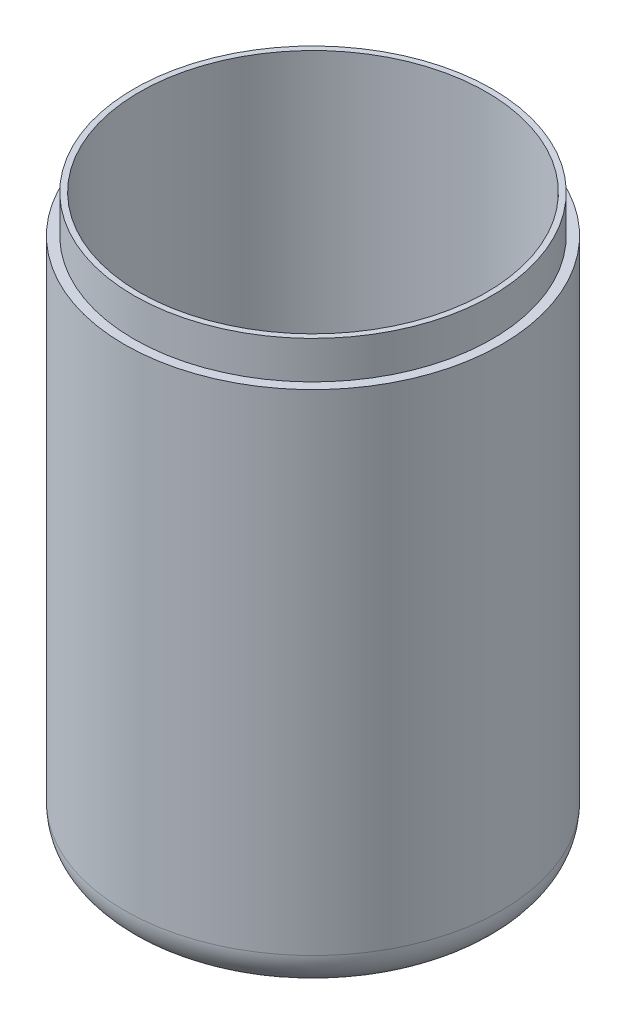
from build123d import *

# Parameters (mm, degrees)
ESQUISSE1_R             = 50
BOSS_EXTRU_1_DEPTH      = 150
ENL_V_START             = -10
ESQUISSE2_R             = 50
ESQUISSE2_R_2           = 47.5
ENL_V_MAT_EXTRU_1_DEPTH = 10
ESQUISSE3_R             = 46.028776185
ENL_V_MAT_EXTRU_2_DEPTH = 133
CONG_1_R                = 10


with BuildPart() as part:
    # Esquisse1 → Boss.-Extru.1 (new body)
    with BuildSketch(Plane(origin=(0, 0, 0), x_dir=(1, 0, 0), z_dir=(0, 1, 0))):
        with Locations(Location((5.893162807, -2.08391867, 0), (0, 0, 270))):
            Circle(ESQUISSE1_R)
    extrude(amount=BOSS_EXTRU_1_DEPTH)

    # Esquisse2 → Enl_v. mat.-Extru.1 (cut)
    with BuildSketch(Plane(origin=(0, 150, 0), x_dir=(1, 0, 0), z_dir=(0, 1, 0)).offset(ENL_V_START)):
        with Locations(Location((5.893162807, -2.08391867, 0), (0, 0, 270))):
            Circle(ESQUISSE2_R)
        with Locations(Location((5.893162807, -2.08391867, 0), (0, 0, 270))):
            Circle(ESQUISSE2_R_2, mode=Mode.SUBTRACT)
    extrude(amount=ENL_V_MAT_EXTRU_1_DEPTH, mode=Mode.SUBTRACT)

    # Esquisse3 → Enl_v. mat.-Extru.2 (cut)
    with BuildSketch(Plane(origin=(0, 150, 0), x_dir=(1, 0, 0), z_dir=(0, 1, 0))):
        with Locations(Location((5.893162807, -2.08391867, 0), (0, 0, 270))):
            Circle(ESQUISSE3_R)
    extrude(amount=-ENL_V_MAT_EXTRU_2_DEPTH, mode=Mode.SUBTRACT)

    # Cong_1
    cong_1_edges = [part.edges().sort_by_distance(p)[0] for p in [
        (5.893162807, 0, -47.91608133),
    ]]
    fillet(cong_1_edges, radius=CONG_1_R)


solid = part.part
